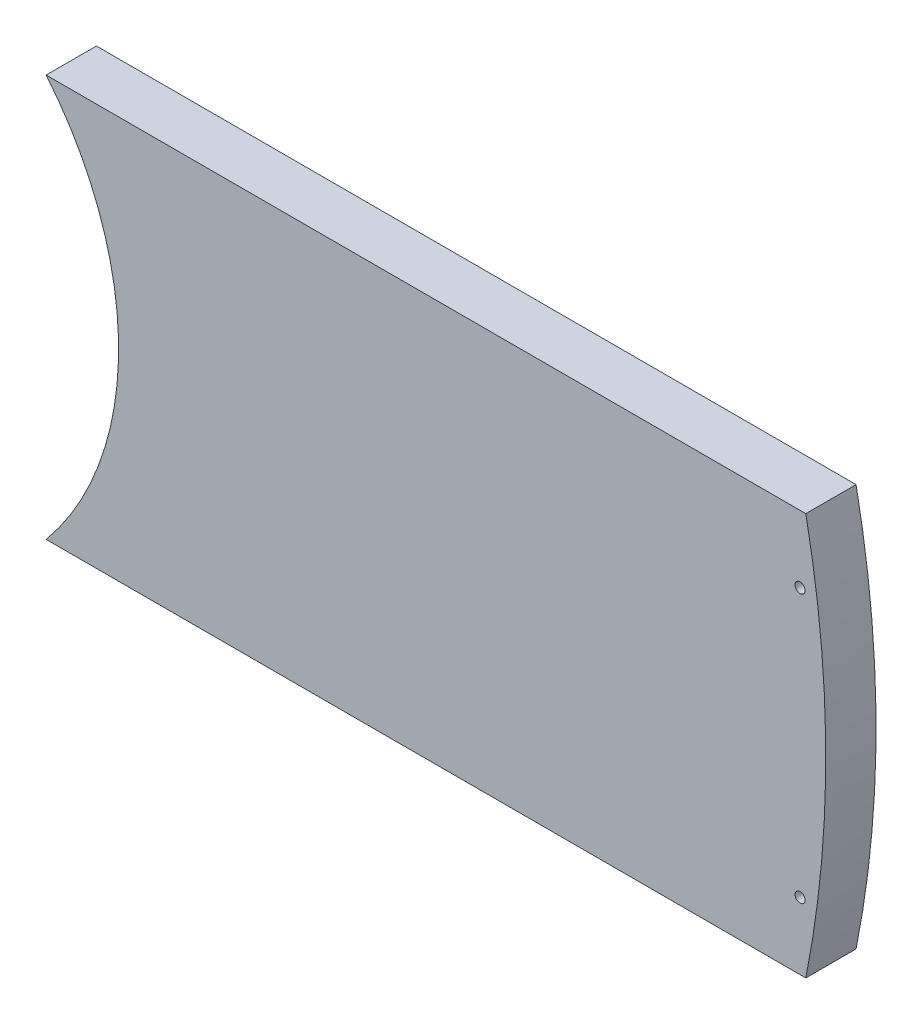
ISO-10303-21;
HEADER;
FILE_DESCRIPTION(('STEP AP214'),'2;1');
FILE_NAME('part.step','',(''),(''),'','','');
FILE_SCHEMA(('AUTOMOTIVE_DESIGN { 1 0 10303 214 1 1 1 1 }'));
ENDSEC;
DATA;
#1=APPLICATION_CONTEXT('core data for automotive mechanical design processes');
#2=APPLICATION_PROTOCOL_DEFINITION('international standard','automotive_design',2000,#1);
#3=PRODUCT_CONTEXT('',#1,'mechanical');
#4=PRODUCT('Part','Part','',(#3));
#5=PRODUCT_RELATED_PRODUCT_CATEGORY('part','',(#4));
#6=PRODUCT_DEFINITION_FORMATION('','',#4);
#7=PRODUCT_DEFINITION_CONTEXT('part definition',#1,'design');
#8=PRODUCT_DEFINITION('design','',#6,#7);
#9=PRODUCT_DEFINITION_SHAPE('','',#8);
#10=(LENGTH_UNIT() NAMED_UNIT(*) SI_UNIT(.MILLI.,.METRE.));
#11=(NAMED_UNIT(*) PLANE_ANGLE_UNIT() SI_UNIT($,.RADIAN.));
#12=(NAMED_UNIT(*) SI_UNIT($,.STERADIAN.) SOLID_ANGLE_UNIT());
#13=UNCERTAINTY_MEASURE_WITH_UNIT(LENGTH_MEASURE(1.E-05),#10,'distance_accuracy_value','');
#14=(GEOMETRIC_REPRESENTATION_CONTEXT(3) GLOBAL_UNCERTAINTY_ASSIGNED_CONTEXT((#13)) GLOBAL_UNIT_ASSIGNED_CONTEXT((#10,
#11,#12)) REPRESENTATION_CONTEXT('',''));
#15=CARTESIAN_POINT('',(0.,0.,0.));
#16=DIRECTION('',(0.,0.,1.));
#17=DIRECTION('',(1.,0.,0.));
#18=AXIS2_PLACEMENT_3D('',#15,#16,#17);
#19=CARTESIAN_POINT('',(0.,0.,15.));
#20=DIRECTION('',(0.,0.,1.));
#21=DIRECTION('',(1.,0.,0.));
#22=AXIS2_PLACEMENT_3D('',#19,#20,#21);
#23=PLANE('',#22);
#24=CARTESIAN_POINT('',(297.32137494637,40.,15.));
#25=DIRECTION('',(0.,0.,1.));
#26=DIRECTION('',(1.,0.,0.));
#27=AXIS2_PLACEMENT_3D('',#24,#25,#26);
#28=CIRCLE('',#27,1.50000000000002);
#29=CARTESIAN_POINT('',(298.82137494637,40.,15.));
#30=VERTEX_POINT('',#29);
#31=EDGE_CURVE('E290',#30,#30,#28,.T.);
#32=ORIENTED_EDGE('',*,*,#31,.F.);
#33=EDGE_LOOP('',(#32));
#34=FACE_BOUND('',#33,.T.);
#35=CARTESIAN_POINT('',(0.,0.,15.));
#36=DIRECTION('',(0.,0.,-1.));
#37=DIRECTION('',(1.,0.,0.));
#38=AXIS2_PLACEMENT_3D('',#35,#36,#37);
#39=CIRCLE('',#38,94.);
#40=CARTESIAN_POINT('',(72.3602100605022,60.,15.));
#41=VERTEX_POINT('',#40);
#42=CARTESIAN_POINT('',(72.3602100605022,-60.,15.));
#43=VERTEX_POINT('',#42);
#44=EDGE_CURVE('E296',#41,#43,#39,.T.);
#45=ORIENTED_EDGE('',*,*,#44,.T.);
#46=DIRECTION('',(1.,0.,0.));
#47=VECTOR('',#46,1.);
#48=CARTESIAN_POINT('',(72.3602100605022,-60.,15.));
#49=LINE('',#48,#47);
#50=CARTESIAN_POINT('',(299.040131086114,-60.0000000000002,15.));
#51=VERTEX_POINT('',#50);
#52=EDGE_CURVE('E299',#43,#51,#49,.T.);
#53=ORIENTED_EDGE('',*,*,#52,.T.);
#54=CARTESIAN_POINT('',(0.,0.,15.));
#55=DIRECTION('',(0.,0.,1.));
#56=DIRECTION('',(1.,0.,0.));
#57=AXIS2_PLACEMENT_3D('',#54,#55,#56);
#58=CIRCLE('',#57,305.);
#59=CARTESIAN_POINT('',(299.040131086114,60.,15.));
#60=VERTEX_POINT('',#59);
#61=EDGE_CURVE('E302',#51,#60,#58,.T.);
#62=ORIENTED_EDGE('',*,*,#61,.T.);
#63=DIRECTION('',(-1.,0.,0.));
#64=VECTOR('',#63,1.);
#65=CARTESIAN_POINT('',(72.3602100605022,60.,15.));
#66=LINE('',#65,#64);
#67=EDGE_CURVE('E304',#60,#41,#66,.T.);
#68=ORIENTED_EDGE('',*,*,#67,.T.);
#69=EDGE_LOOP('',(#45,#53,#62,#68));
#70=FACE_BOUND('',#69,.T.);
#71=CARTESIAN_POINT('',(297.32137494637,-40.,15.));
#72=DIRECTION('',(0.,0.,1.));
#73=DIRECTION('',(-1.,0.,0.));
#74=AXIS2_PLACEMENT_3D('',#71,#72,#73);
#75=CIRCLE('',#74,1.50000000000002);
#76=CARTESIAN_POINT('',(295.82137494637,-40.,15.));
#77=VERTEX_POINT('',#76);
#78=EDGE_CURVE('E284',#77,#77,#75,.T.);
#79=ORIENTED_EDGE('',*,*,#78,.F.);
#80=EDGE_LOOP('',(#79));
#81=FACE_BOUND('',#80,.T.);
#82=ADVANCED_FACE('F35',(#34,#70,#81),#23,.T.);
#83=CARTESIAN_POINT('',(0.,0.,0.));
#84=DIRECTION('',(0.,0.,1.));
#85=DIRECTION('',(1.,0.,0.));
#86=AXIS2_PLACEMENT_3D('',#83,#84,#85);
#87=PLANE('',#86);
#88=DIRECTION('',(1.,0.,0.));
#89=VECTOR('',#88,1.);
#90=CARTESIAN_POINT('',(118.,15.,0.));
#91=LINE('',#90,#89);
#92=CARTESIAN_POINT('',(95.8331884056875,15.,0.));
#93=VERTEX_POINT('',#92);
#94=CARTESIAN_POINT('',(121.,15.,0.));
#95=VERTEX_POINT('',#94);
#96=EDGE_CURVE('E248',#93,#95,#91,.T.);
#97=ORIENTED_EDGE('',*,*,#96,.T.);
#98=DIRECTION('',(0.,-1.,0.));
#99=VECTOR('',#98,1.);
#100=CARTESIAN_POINT('',(121.,12.,0.));
#101=LINE('',#100,#99);
#102=CARTESIAN_POINT('',(121.,-15.,0.));
#103=VERTEX_POINT('',#102);
#104=EDGE_CURVE('E534',#95,#103,#101,.T.);
#105=ORIENTED_EDGE('',*,*,#104,.T.);
#106=DIRECTION('',(-1.,0.,0.));
#107=VECTOR('',#106,1.);
#108=CARTESIAN_POINT('',(118.,-15.,0.));
#109=LINE('',#108,#107);
#110=CARTESIAN_POINT('',(95.8331884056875,-15.,0.));
#111=VERTEX_POINT('',#110);
#112=EDGE_CURVE('E539',#103,#111,#109,.T.);
#113=ORIENTED_EDGE('',*,*,#112,.T.);
#114=CARTESIAN_POINT('',(0.,0.,0.));
#115=DIRECTION('',(0.,0.,1.));
#116=DIRECTION('',(1.,0.,0.));
#117=AXIS2_PLACEMENT_3D('',#114,#115,#116);
#118=CIRCLE('',#117,97.);
#119=CARTESIAN_POINT('',(78.4856674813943,-57.,0.));
#120=VERTEX_POINT('',#119);
#121=EDGE_CURVE('E50',#111,#120,#118,.F.);
#122=ORIENTED_EDGE('',*,*,#121,.T.);
#123=DIRECTION('',(1.,0.,0.));
#124=VECTOR('',#123,1.);
#125=CARTESIAN_POINT('',(72.3602100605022,-57.,0.));
#126=LINE('',#125,#124);
#127=CARTESIAN_POINT('',(296.572082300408,-57.,0.));
#128=VERTEX_POINT('',#127);
#129=EDGE_CURVE('E546',#120,#128,#126,.T.);
#130=ORIENTED_EDGE('',*,*,#129,.T.);
#131=CARTESIAN_POINT('',(0.,0.,0.));
#132=DIRECTION('',(0.,0.,1.));
#133=DIRECTION('',(1.,0.,0.));
#134=AXIS2_PLACEMENT_3D('',#131,#132,#133);
#135=CIRCLE('',#134,302.);
#136=CARTESIAN_POINT('',(298.737415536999,-44.271396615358,0.));
#137=VERTEX_POINT('',#136);
#138=EDGE_CURVE('E193',#128,#137,#135,.T.);
#139=ORIENTED_EDGE('',*,*,#138,.T.);
#140=CARTESIAN_POINT('',(297.32137494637,-40.,0.));
#141=DIRECTION('',(0.,0.,1.));
#142=DIRECTION('',(1.,0.,0.));
#143=AXIS2_PLACEMENT_3D('',#140,#141,#142);
#144=CIRCLE('',#143,4.50000000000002);
#145=CARTESIAN_POINT('',(299.815936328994,-36.2547144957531,0.));
#146=VERTEX_POINT('',#145);
#147=EDGE_CURVE('E244',#146,#137,#144,.T.);
#148=ORIENTED_EDGE('',*,*,#147,.F.);
#149=CARTESIAN_POINT('',(299.815936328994,36.2547144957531,0.));
#150=VERTEX_POINT('',#149);
#151=EDGE_CURVE('E548',#146,#150,#135,.T.);
#152=ORIENTED_EDGE('',*,*,#151,.T.);
#153=CARTESIAN_POINT('',(297.32137494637,40.,0.));
#154=DIRECTION('',(0.,0.,1.));
#155=DIRECTION('',(1.,0.,0.));
#156=AXIS2_PLACEMENT_3D('',#153,#154,#155);
#157=CIRCLE('',#156,4.50000000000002);
#158=CARTESIAN_POINT('',(298.737415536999,44.271396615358,0.));
#159=VERTEX_POINT('',#158);
#160=EDGE_CURVE('E236',#159,#150,#157,.T.);
#161=ORIENTED_EDGE('',*,*,#160,.F.);
#162=CARTESIAN_POINT('',(296.572082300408,57.,0.));
#163=VERTEX_POINT('',#162);
#164=EDGE_CURVE('E232',#159,#163,#135,.T.);
#165=ORIENTED_EDGE('',*,*,#164,.T.);
#166=DIRECTION('',(-1.,0.,0.));
#167=VECTOR('',#166,1.);
#168=CARTESIAN_POINT('',(72.3602100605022,57.,0.));
#169=LINE('',#168,#167);
#170=CARTESIAN_POINT('',(78.4856674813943,57.,0.));
#171=VERTEX_POINT('',#170);
#172=EDGE_CURVE('E223',#163,#171,#169,.T.);
#173=ORIENTED_EDGE('',*,*,#172,.T.);
#174=CARTESIAN_POINT('',(0.,0.,0.));
#175=DIRECTION('',(0.,0.,1.));
#176=DIRECTION('',(1.,0.,0.));
#177=AXIS2_PLACEMENT_3D('',#174,#175,#176);
#178=CIRCLE('',#177,97.);
#179=EDGE_CURVE('E237',#171,#93,#178,.F.);
#180=ORIENTED_EDGE('',*,*,#179,.T.);
#181=EDGE_LOOP('',(#97,#105,#113,#122,#130,#139,#148,#152,#161,#165,#173,#180));
#182=FACE_BOUND('',#181,.T.);
#183=CARTESIAN_POINT('',(297.32137494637,40.,0.));
#184=DIRECTION('',(0.,0.,1.));
#185=DIRECTION('',(1.,0.,0.));
#186=AXIS2_PLACEMENT_3D('',#183,#184,#185);
#187=CIRCLE('',#186,1.50000000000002);
#188=CARTESIAN_POINT('',(298.82137494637,40.,0.));
#189=VERTEX_POINT('',#188);
#190=EDGE_CURVE('E287',#189,#189,#187,.T.);
#191=ORIENTED_EDGE('',*,*,#190,.T.);
#192=EDGE_LOOP('',(#191));
#193=FACE_BOUND('',#192,.T.);
#194=DIRECTION('',(0.,-1.,0.));
#195=VECTOR('',#194,1.);
#196=CARTESIAN_POINT('',(118.,12.,0.));
#197=LINE('',#196,#195);
#198=CARTESIAN_POINT('',(118.,12.,0.));
#199=VERTEX_POINT('',#198);
#200=CARTESIAN_POINT('',(118.,-12.,0.));
#201=VERTEX_POINT('',#200);
#202=EDGE_CURVE('E266',#199,#201,#197,.T.);
#203=ORIENTED_EDGE('',*,*,#202,.F.);
#204=DIRECTION('',(1.,0.,0.));
#205=VECTOR('',#204,1.);
#206=CARTESIAN_POINT('',(118.,12.,0.));
#207=LINE('',#206,#205);
#208=CARTESIAN_POINT('',(93.2308961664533,12.,0.));
#209=VERTEX_POINT('',#208);
#210=EDGE_CURVE('E269',#209,#199,#207,.T.);
#211=ORIENTED_EDGE('',*,*,#210,.F.);
#212=CARTESIAN_POINT('',(0.,0.,0.));
#213=DIRECTION('',(0.,0.,-1.));
#214=DIRECTION('',(1.,0.,0.));
#215=AXIS2_PLACEMENT_3D('',#212,#213,#214);
#216=CIRCLE('',#215,94.);
#217=CARTESIAN_POINT('',(72.3602100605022,60.,0.));
#218=VERTEX_POINT('',#217);
#219=EDGE_CURVE('E307',#218,#209,#216,.T.);
#220=ORIENTED_EDGE('',*,*,#219,.F.);
#221=DIRECTION('',(-1.,0.,0.));
#222=VECTOR('',#221,1.);
#223=CARTESIAN_POINT('',(72.3602100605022,60.,0.));
#224=LINE('',#223,#222);
#225=CARTESIAN_POINT('',(299.040131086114,60.,0.));
#226=VERTEX_POINT('',#225);
#227=EDGE_CURVE('E300',#226,#218,#224,.T.);
#228=ORIENTED_EDGE('',*,*,#227,.F.);
#229=CARTESIAN_POINT('',(0.,0.,0.));
#230=DIRECTION('',(0.,0.,1.));
#231=DIRECTION('',(1.,0.,0.));
#232=AXIS2_PLACEMENT_3D('',#229,#230,#231);
#233=CIRCLE('',#232,305.);
#234=CARTESIAN_POINT('',(299.040131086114,-60.0000000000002,0.));
#235=VERTEX_POINT('',#234);
#236=EDGE_CURVE('E312',#235,#226,#233,.T.);
#237=ORIENTED_EDGE('',*,*,#236,.F.);
#238=DIRECTION('',(1.,0.,0.));
#239=VECTOR('',#238,1.);
#240=CARTESIAN_POINT('',(72.3602100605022,-60.,0.));
#241=LINE('',#240,#239);
#242=CARTESIAN_POINT('',(72.3602100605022,-60.,0.));
#243=VERTEX_POINT('',#242);
#244=EDGE_CURVE('E310',#243,#235,#241,.T.);
#245=ORIENTED_EDGE('',*,*,#244,.F.);
#246=CARTESIAN_POINT('',(93.2308961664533,-12.,0.));
#247=VERTEX_POINT('',#246);
#248=EDGE_CURVE('E293',#247,#243,#216,.T.);
#249=ORIENTED_EDGE('',*,*,#248,.F.);
#250=DIRECTION('',(-1.,0.,0.));
#251=VECTOR('',#250,1.);
#252=CARTESIAN_POINT('',(118.,-12.,0.));
#253=LINE('',#252,#251);
#254=EDGE_CURVE('E276',#201,#247,#253,.T.);
#255=ORIENTED_EDGE('',*,*,#254,.F.);
#256=EDGE_LOOP('',(#203,#211,#220,#228,#237,#245,#249,#255));
#257=FACE_BOUND('',#256,.T.);
#258=CARTESIAN_POINT('',(297.32137494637,-40.,0.));
#259=DIRECTION('',(0.,0.,1.));
#260=DIRECTION('',(-1.,0.,0.));
#261=AXIS2_PLACEMENT_3D('',#258,#259,#260);
#262=CIRCLE('',#261,1.50000000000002);
#263=CARTESIAN_POINT('',(295.82137494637,-40.,0.));
#264=VERTEX_POINT('',#263);
#265=EDGE_CURVE('E282',#264,#264,#262,.T.);
#266=ORIENTED_EDGE('',*,*,#265,.T.);
#267=EDGE_LOOP('',(#266));
#268=FACE_BOUND('',#267,.T.);
#269=ADVANCED_FACE('F337',(#182,#193,#257,#268),#87,.F.);
#270=CARTESIAN_POINT('',(0.,0.,15.));
#271=DIRECTION('',(0.,0.,-1.));
#272=DIRECTION('',(-1.,0.,0.));
#273=AXIS2_PLACEMENT_3D('',#270,#271,#272);
#274=CYLINDRICAL_SURFACE('',#273,94.);
#275=ORIENTED_EDGE('',*,*,#219,.T.);
#276=DIRECTION('',(0.,0.,-1.));
#277=VECTOR('',#276,1.);
#278=CARTESIAN_POINT('',(93.2308961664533,12.,15.));
#279=LINE('',#278,#277);
#280=CARTESIAN_POINT('',(93.2308961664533,12.,12.));
#281=VERTEX_POINT('',#280);
#282=EDGE_CURVE('E11',#209,#281,#279,.F.);
#283=ORIENTED_EDGE('',*,*,#282,.T.);
#284=CARTESIAN_POINT('',(0.,0.,12.));
#285=DIRECTION('',(0.,0.,-1.));
#286=DIRECTION('',(-1.,0.,0.));
#287=AXIS2_PLACEMENT_3D('',#284,#285,#286);
#288=CIRCLE('',#287,94.);
#289=CARTESIAN_POINT('',(93.2308961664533,-12.,12.));
#290=VERTEX_POINT('',#289);
#291=EDGE_CURVE('E326',#290,#281,#288,.F.);
#292=ORIENTED_EDGE('',*,*,#291,.F.);
#293=DIRECTION('',(0.,0.,-1.));
#294=VECTOR('',#293,1.);
#295=CARTESIAN_POINT('',(93.2308961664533,-12.,15.));
#296=LINE('',#295,#294);
#297=EDGE_CURVE('E43',#290,#247,#296,.T.);
#298=ORIENTED_EDGE('',*,*,#297,.T.);
#299=ORIENTED_EDGE('',*,*,#248,.T.);
#300=DIRECTION('',(0.,0.,-1.));
#301=VECTOR('',#300,1.);
#302=CARTESIAN_POINT('',(72.3602100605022,-60.,15.));
#303=LINE('',#302,#301);
#304=EDGE_CURVE('E323',#43,#243,#303,.T.);
#305=ORIENTED_EDGE('',*,*,#304,.F.);
#306=ORIENTED_EDGE('',*,*,#44,.F.);
#307=DIRECTION('',(0.,0.,-1.));
#308=VECTOR('',#307,1.);
#309=CARTESIAN_POINT('',(72.3602100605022,60.,15.));
#310=LINE('',#309,#308);
#311=EDGE_CURVE('E306',#41,#218,#310,.T.);
#312=ORIENTED_EDGE('',*,*,#311,.T.);
#313=EDGE_LOOP('',(#275,#283,#292,#298,#299,#305,#306,#312));
#314=FACE_BOUND('',#313,.T.);
#315=ADVANCED_FACE('F37',(#314),#274,.F.);
#316=CARTESIAN_POINT('',(72.3602100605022,-60.,15.));
#317=DIRECTION('',(0.,1.,0.));
#318=DIRECTION('',(0.,0.,1.));
#319=AXIS2_PLACEMENT_3D('',#316,#317,#318);
#320=PLANE('',#319);
#321=ORIENTED_EDGE('',*,*,#244,.T.);
#322=DIRECTION('',(0.,0.,-1.));
#323=VECTOR('',#322,1.);
#324=CARTESIAN_POINT('',(299.040131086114,-60.0000000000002,15.));
#325=LINE('',#324,#323);
#326=EDGE_CURVE('E320',#51,#235,#325,.T.);
#327=ORIENTED_EDGE('',*,*,#326,.F.);
#328=ORIENTED_EDGE('',*,*,#52,.F.);
#329=ORIENTED_EDGE('',*,*,#304,.T.);
#330=EDGE_LOOP('',(#321,#327,#328,#329));
#331=FACE_BOUND('',#330,.T.);
#332=ADVANCED_FACE('F343',(#331),#320,.F.);
#333=CARTESIAN_POINT('',(0.,0.,15.));
#334=DIRECTION('',(0.,0.,-1.));
#335=DIRECTION('',(-1.,0.,0.));
#336=AXIS2_PLACEMENT_3D('',#333,#334,#335);
#337=CYLINDRICAL_SURFACE('',#336,305.);
#338=ORIENTED_EDGE('',*,*,#236,.T.);
#339=DIRECTION('',(0.,0.,-1.));
#340=VECTOR('',#339,1.);
#341=CARTESIAN_POINT('',(299.040131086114,60.,15.));
#342=LINE('',#341,#340);
#343=EDGE_CURVE('E317',#60,#226,#342,.T.);
#344=ORIENTED_EDGE('',*,*,#343,.F.);
#345=ORIENTED_EDGE('',*,*,#61,.F.);
#346=ORIENTED_EDGE('',*,*,#326,.T.);
#347=EDGE_LOOP('',(#338,#344,#345,#346));
#348=FACE_BOUND('',#347,.T.);
#349=ADVANCED_FACE('F389',(#348),#337,.T.);
#350=CARTESIAN_POINT('',(72.3602100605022,60.,15.));
#351=DIRECTION('',(0.,-1.,0.));
#352=DIRECTION('',(0.,0.,-1.));
#353=AXIS2_PLACEMENT_3D('',#350,#351,#352);
#354=PLANE('',#353);
#355=ORIENTED_EDGE('',*,*,#227,.T.);
#356=ORIENTED_EDGE('',*,*,#311,.F.);
#357=ORIENTED_EDGE('',*,*,#67,.F.);
#358=ORIENTED_EDGE('',*,*,#343,.T.);
#359=EDGE_LOOP('',(#355,#356,#357,#358));
#360=FACE_BOUND('',#359,.T.);
#361=ADVANCED_FACE('F353',(#360),#354,.F.);
#362=CARTESIAN_POINT('',(297.32137494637,40.,15.));
#363=DIRECTION('',(0.,0.,-1.));
#364=DIRECTION('',(-1.,0.,0.));
#365=AXIS2_PLACEMENT_3D('',#362,#363,#364);
#366=CYLINDRICAL_SURFACE('',#365,1.50000000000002);
#367=ORIENTED_EDGE('',*,*,#31,.T.);
#368=EDGE_LOOP('',(#367));
#369=FACE_BOUND('',#368,.T.);
#370=ORIENTED_EDGE('',*,*,#190,.F.);
#371=EDGE_LOOP('',(#370));
#372=FACE_BOUND('',#371,.T.);
#373=ADVANCED_FACE('F384',(#369,#372),#366,.F.);
#374=CARTESIAN_POINT('',(297.32137494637,-40.,15.));
#375=DIRECTION('',(0.,0.,-1.));
#376=DIRECTION('',(-1.,0.,0.));
#377=AXIS2_PLACEMENT_3D('',#374,#375,#376);
#378=CYLINDRICAL_SURFACE('',#377,1.50000000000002);
#379=ORIENTED_EDGE('',*,*,#78,.T.);
#380=EDGE_LOOP('',(#379));
#381=FACE_BOUND('',#380,.T.);
#382=ORIENTED_EDGE('',*,*,#265,.F.);
#383=EDGE_LOOP('',(#382));
#384=FACE_BOUND('',#383,.T.);
#385=ADVANCED_FACE('F371',(#381,#384),#378,.F.);
#386=CARTESIAN_POINT('',(118.,12.,12.));
#387=DIRECTION('',(0.,1.,0.));
#388=DIRECTION('',(-1.,0.,0.));
#389=AXIS2_PLACEMENT_3D('',#386,#387,#388);
#390=PLANE('',#389);
#391=ORIENTED_EDGE('',*,*,#210,.T.);
#392=DIRECTION('',(0.,0.,-1.));
#393=VECTOR('',#392,1.);
#394=CARTESIAN_POINT('',(118.,12.,12.));
#395=LINE('',#394,#393);
#396=CARTESIAN_POINT('',(118.,12.,12.));
#397=VERTEX_POINT('',#396);
#398=EDGE_CURVE('E279',#397,#199,#395,.T.);
#399=ORIENTED_EDGE('',*,*,#398,.F.);
#400=DIRECTION('',(1.,0.,0.));
#401=VECTOR('',#400,1.);
#402=CARTESIAN_POINT('',(118.,12.,12.));
#403=LINE('',#402,#401);
#404=EDGE_CURVE('E271',#281,#397,#403,.T.);
#405=ORIENTED_EDGE('',*,*,#404,.F.);
#406=ORIENTED_EDGE('',*,*,#282,.F.);
#407=EDGE_LOOP('',(#391,#399,#405,#406));
#408=FACE_BOUND('',#407,.T.);
#409=ADVANCED_FACE('F357',(#408),#390,.F.);
#410=CARTESIAN_POINT('',(118.,-12.,12.));
#411=DIRECTION('',(0.,-1.,0.));
#412=DIRECTION('',(1.,0.,0.));
#413=AXIS2_PLACEMENT_3D('',#410,#411,#412);
#414=PLANE('',#413);
#415=DIRECTION('',(-1.,0.,0.));
#416=VECTOR('',#415,1.);
#417=CARTESIAN_POINT('',(118.,-12.,12.));
#418=LINE('',#417,#416);
#419=CARTESIAN_POINT('',(118.,-12.,12.));
#420=VERTEX_POINT('',#419);
#421=EDGE_CURVE('E58',#420,#290,#418,.T.);
#422=ORIENTED_EDGE('',*,*,#421,.F.);
#423=DIRECTION('',(0.,0.,-1.));
#424=VECTOR('',#423,1.);
#425=CARTESIAN_POINT('',(118.,-12.,12.));
#426=LINE('',#425,#424);
#427=EDGE_CURVE('E273',#420,#201,#426,.T.);
#428=ORIENTED_EDGE('',*,*,#427,.T.);
#429=ORIENTED_EDGE('',*,*,#254,.T.);
#430=ORIENTED_EDGE('',*,*,#297,.F.);
#431=EDGE_LOOP('',(#422,#428,#429,#430));
#432=FACE_BOUND('',#431,.T.);
#433=ADVANCED_FACE('F363',(#432),#414,.F.);
#434=CARTESIAN_POINT('',(0.,0.,12.));
#435=DIRECTION('',(0.,0.,-1.));
#436=DIRECTION('',(-1.,0.,0.));
#437=AXIS2_PLACEMENT_3D('',#434,#435,#436);
#438=PLANE('',#437);
#439=ORIENTED_EDGE('',*,*,#291,.T.);
#440=ORIENTED_EDGE('',*,*,#404,.T.);
#441=DIRECTION('',(0.,-1.,0.));
#442=VECTOR('',#441,1.);
#443=CARTESIAN_POINT('',(118.,12.,12.));
#444=LINE('',#443,#442);
#445=EDGE_CURVE('E267',#397,#420,#444,.T.);
#446=ORIENTED_EDGE('',*,*,#445,.T.);
#447=ORIENTED_EDGE('',*,*,#421,.T.);
#448=EDGE_LOOP('',(#439,#440,#446,#447));
#449=FACE_BOUND('',#448,.T.);
#450=ADVANCED_FACE('F360',(#449),#438,.T.);
#451=CARTESIAN_POINT('',(118.,12.,12.));
#452=DIRECTION('',(1.,0.,0.));
#453=DIRECTION('',(0.,0.,-1.));
#454=AXIS2_PLACEMENT_3D('',#451,#452,#453);
#455=PLANE('',#454);
#456=ORIENTED_EDGE('',*,*,#202,.T.);
#457=ORIENTED_EDGE('',*,*,#427,.F.);
#458=ORIENTED_EDGE('',*,*,#445,.F.);
#459=ORIENTED_EDGE('',*,*,#398,.T.);
#460=EDGE_LOOP('',(#456,#457,#458,#459));
#461=FACE_BOUND('',#460,.T.);
#462=ADVANCED_FACE('F362',(#461),#455,.F.);
#463=CARTESIAN_POINT('',(0.,0.,12.));
#464=DIRECTION('',(0.,0.,1.));
#465=DIRECTION('',(1.,0.,0.));
#466=AXIS2_PLACEMENT_3D('',#463,#464,#465);
#467=PLANE('',#466);
#468=DIRECTION('',(0.,1.,0.));
#469=VECTOR('',#468,1.);
#470=CARTESIAN_POINT('',(121.,0.,12.));
#471=LINE('',#470,#469);
#472=CARTESIAN_POINT('',(121.,-15.,12.));
#473=VERTEX_POINT('',#472);
#474=CARTESIAN_POINT('',(121.,15.,12.));
#475=VERTEX_POINT('',#474);
#476=EDGE_CURVE('E264',#473,#475,#471,.T.);
#477=ORIENTED_EDGE('',*,*,#476,.T.);
#478=DIRECTION('',(1.,0.,0.));
#479=VECTOR('',#478,1.);
#480=CARTESIAN_POINT('',(118.,15.,12.));
#481=LINE('',#480,#479);
#482=CARTESIAN_POINT('',(95.8331884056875,15.,12.));
#483=VERTEX_POINT('',#482);
#484=EDGE_CURVE('E228',#483,#475,#481,.T.);
#485=ORIENTED_EDGE('',*,*,#484,.F.);
#486=CARTESIAN_POINT('',(0.,0.,12.));
#487=DIRECTION('',(0.,0.,1.));
#488=DIRECTION('',(1.,0.,0.));
#489=AXIS2_PLACEMENT_3D('',#486,#487,#488);
#490=CIRCLE('',#489,97.);
#491=CARTESIAN_POINT('',(78.4856674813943,57.,12.));
#492=VERTEX_POINT('',#491);
#493=EDGE_CURVE('E227',#492,#483,#490,.F.);
#494=ORIENTED_EDGE('',*,*,#493,.F.);
#495=DIRECTION('',(-1.,0.,0.));
#496=VECTOR('',#495,1.);
#497=CARTESIAN_POINT('',(72.3602100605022,57.,12.));
#498=LINE('',#497,#496);
#499=CARTESIAN_POINT('',(296.572082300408,57.,12.));
#500=VERTEX_POINT('',#499);
#501=EDGE_CURVE('E202',#500,#492,#498,.T.);
#502=ORIENTED_EDGE('',*,*,#501,.F.);
#503=CARTESIAN_POINT('',(0.,0.,12.));
#504=DIRECTION('',(0.,0.,1.));
#505=DIRECTION('',(1.,0.,0.));
#506=AXIS2_PLACEMENT_3D('',#503,#504,#505);
#507=CIRCLE('',#506,302.);
#508=CARTESIAN_POINT('',(298.737415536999,44.271396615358,12.));
#509=VERTEX_POINT('',#508);
#510=EDGE_CURVE('E185',#509,#500,#507,.T.);
#511=ORIENTED_EDGE('',*,*,#510,.F.);
#512=CARTESIAN_POINT('',(297.32137494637,40.,12.));
#513=DIRECTION('',(0.,0.,1.));
#514=DIRECTION('',(1.,0.,0.));
#515=AXIS2_PLACEMENT_3D('',#512,#513,#514);
#516=CIRCLE('',#515,4.50000000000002);
#517=CARTESIAN_POINT('',(299.815936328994,36.2547144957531,12.));
#518=VERTEX_POINT('',#517);
#519=EDGE_CURVE('E235',#509,#518,#516,.T.);
#520=ORIENTED_EDGE('',*,*,#519,.T.);
#521=CARTESIAN_POINT('',(299.815936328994,-36.2547144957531,12.));
#522=VERTEX_POINT('',#521);
#523=EDGE_CURVE('E203',#522,#518,#507,.T.);
#524=ORIENTED_EDGE('',*,*,#523,.F.);
#525=CARTESIAN_POINT('',(297.32137494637,-40.,12.));
#526=DIRECTION('',(0.,0.,1.));
#527=DIRECTION('',(1.,0.,0.));
#528=AXIS2_PLACEMENT_3D('',#525,#526,#527);
#529=CIRCLE('',#528,4.50000000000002);
#530=CARTESIAN_POINT('',(298.737415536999,-44.271396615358,12.));
#531=VERTEX_POINT('',#530);
#532=EDGE_CURVE('E201',#522,#531,#529,.T.);
#533=ORIENTED_EDGE('',*,*,#532,.T.);
#534=CARTESIAN_POINT('',(296.572082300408,-57.,12.));
#535=VERTEX_POINT('',#534);
#536=EDGE_CURVE('E191',#535,#531,#507,.T.);
#537=ORIENTED_EDGE('',*,*,#536,.F.);
#538=DIRECTION('',(1.,0.,0.));
#539=VECTOR('',#538,1.);
#540=CARTESIAN_POINT('',(72.3602100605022,-57.,12.));
#541=LINE('',#540,#539);
#542=CARTESIAN_POINT('',(78.4856674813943,-57.,12.));
#543=VERTEX_POINT('',#542);
#544=EDGE_CURVE('E175',#543,#535,#541,.T.);
#545=ORIENTED_EDGE('',*,*,#544,.F.);
#546=CARTESIAN_POINT('',(95.8331884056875,-15.,12.));
#547=VERTEX_POINT('',#546);
#548=EDGE_CURVE('E186',#547,#543,#490,.F.);
#549=ORIENTED_EDGE('',*,*,#548,.F.);
#550=DIRECTION('',(-1.,0.,0.));
#551=VECTOR('',#550,1.);
#552=CARTESIAN_POINT('',(118.,-15.,12.));
#553=LINE('',#552,#551);
#554=EDGE_CURVE('E262',#473,#547,#553,.T.);
#555=ORIENTED_EDGE('',*,*,#554,.F.);
#556=EDGE_LOOP('',(#477,#485,#494,#502,#511,#520,#524,#533,#537,#545,#549,#555));
#557=FACE_BOUND('',#556,.T.);
#558=ADVANCED_FACE('F198',(#557),#467,.F.);
#559=CARTESIAN_POINT('',(118.,15.,12.));
#560=DIRECTION('',(0.,1.,0.));
#561=DIRECTION('',(-1.,0.,0.));
#562=AXIS2_PLACEMENT_3D('',#559,#560,#561);
#563=PLANE('',#562);
#564=ORIENTED_EDGE('',*,*,#484,.T.);
#565=DIRECTION('',(0.,0.,-1.));
#566=VECTOR('',#565,1.);
#567=CARTESIAN_POINT('',(121.,15.,12.));
#568=LINE('',#567,#566);
#569=EDGE_CURVE('E252',#475,#95,#568,.T.);
#570=ORIENTED_EDGE('',*,*,#569,.T.);
#571=ORIENTED_EDGE('',*,*,#96,.F.);
#572=DIRECTION('',(0.,0.,-1.));
#573=VECTOR('',#572,1.);
#574=CARTESIAN_POINT('',(95.8331884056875,15.,0.));
#575=LINE('',#574,#573);
#576=EDGE_CURVE('E256',#93,#483,#575,.F.);
#577=ORIENTED_EDGE('',*,*,#576,.T.);
#578=EDGE_LOOP('',(#564,#570,#571,#577));
#579=FACE_BOUND('',#578,.T.);
#580=ADVANCED_FACE('F419',(#579),#563,.T.);
#581=CARTESIAN_POINT('',(0.,0.,15.));
#582=DIRECTION('',(0.,0.,-1.));
#583=DIRECTION('',(-1.,0.,0.));
#584=AXIS2_PLACEMENT_3D('',#581,#582,#583);
#585=CYLINDRICAL_SURFACE('',#584,302.);
#586=ORIENTED_EDGE('',*,*,#510,.T.);
#587=DIRECTION('',(0.,0.,-1.));
#588=VECTOR('',#587,1.);
#589=CARTESIAN_POINT('',(296.572082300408,57.,12.));
#590=LINE('',#589,#588);
#591=EDGE_CURVE('E194',#500,#163,#590,.T.);
#592=ORIENTED_EDGE('',*,*,#591,.T.);
#593=ORIENTED_EDGE('',*,*,#164,.F.);
#594=DIRECTION('',(0.,0.,-1.));
#595=VECTOR('',#594,1.);
#596=CARTESIAN_POINT('',(298.737415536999,44.271396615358,15.));
#597=LINE('',#596,#595);
#598=EDGE_CURVE('E215',#509,#159,#597,.T.);
#599=ORIENTED_EDGE('',*,*,#598,.F.);
#600=EDGE_LOOP('',(#586,#592,#593,#599));
#601=FACE_BOUND('',#600,.T.);
#602=ADVANCED_FACE('F212',(#601),#585,.F.);
#603=DIRECTION('',(0.,0.,-1.));
#604=VECTOR('',#603,1.);
#605=CARTESIAN_POINT('',(299.815936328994,36.2547144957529,15.));
#606=LINE('',#605,#604);
#607=EDGE_CURVE('E258',#518,#150,#606,.T.);
#608=ORIENTED_EDGE('',*,*,#607,.T.);
#609=ORIENTED_EDGE('',*,*,#151,.F.);
#610=DIRECTION('',(0.,0.,-1.));
#611=VECTOR('',#610,1.);
#612=CARTESIAN_POINT('',(299.815936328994,-36.2547144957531,15.));
#613=LINE('',#612,#611);
#614=EDGE_CURVE('E255',#522,#146,#613,.T.);
#615=ORIENTED_EDGE('',*,*,#614,.F.);
#616=ORIENTED_EDGE('',*,*,#523,.T.);
#617=EDGE_LOOP('',(#608,#609,#615,#616));
#618=FACE_BOUND('',#617,.T.);
#619=ADVANCED_FACE('F440',(#618),#585,.F.);
#620=CARTESIAN_POINT('',(0.,0.,15.));
#621=DIRECTION('',(0.,0.,-1.));
#622=DIRECTION('',(-1.,0.,0.));
#623=AXIS2_PLACEMENT_3D('',#620,#621,#622);
#624=CYLINDRICAL_SURFACE('',#623,97.);
#625=ORIENTED_EDGE('',*,*,#576,.F.);
#626=ORIENTED_EDGE('',*,*,#179,.F.);
#627=DIRECTION('',(0.,0.,-1.));
#628=VECTOR('',#627,1.);
#629=CARTESIAN_POINT('',(78.4856674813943,57.,12.));
#630=LINE('',#629,#628);
#631=EDGE_CURVE('E206',#492,#171,#630,.T.);
#632=ORIENTED_EDGE('',*,*,#631,.F.);
#633=ORIENTED_EDGE('',*,*,#493,.T.);
#634=EDGE_LOOP('',(#625,#626,#632,#633));
#635=FACE_BOUND('',#634,.T.);
#636=ADVANCED_FACE('F450',(#635),#624,.T.);
#637=ORIENTED_EDGE('',*,*,#548,.T.);
#638=DIRECTION('',(0.,0.,-1.));
#639=VECTOR('',#638,1.);
#640=CARTESIAN_POINT('',(78.4856674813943,-57.,12.));
#641=LINE('',#640,#639);
#642=EDGE_CURVE('E180',#543,#120,#641,.T.);
#643=ORIENTED_EDGE('',*,*,#642,.T.);
#644=ORIENTED_EDGE('',*,*,#121,.F.);
#645=DIRECTION('',(0.,0.,-1.));
#646=VECTOR('',#645,1.);
#647=CARTESIAN_POINT('',(95.8331884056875,-15.,15.));
#648=LINE('',#647,#646);
#649=EDGE_CURVE('E540',#547,#111,#648,.T.);
#650=ORIENTED_EDGE('',*,*,#649,.F.);
#651=EDGE_LOOP('',(#637,#643,#644,#650));
#652=FACE_BOUND('',#651,.T.);
#653=ADVANCED_FACE('F460',(#652),#624,.T.);
#654=CARTESIAN_POINT('',(72.3602100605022,-57.,15.));
#655=DIRECTION('',(0.,1.,0.));
#656=DIRECTION('',(0.,0.,1.));
#657=AXIS2_PLACEMENT_3D('',#654,#655,#656);
#658=PLANE('',#657);
#659=ORIENTED_EDGE('',*,*,#129,.F.);
#660=ORIENTED_EDGE('',*,*,#642,.F.);
#661=ORIENTED_EDGE('',*,*,#544,.T.);
#662=DIRECTION('',(0.,0.,-1.));
#663=VECTOR('',#662,1.);
#664=CARTESIAN_POINT('',(296.572082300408,-57.,12.));
#665=LINE('',#664,#663);
#666=EDGE_CURVE('E178',#535,#128,#665,.T.);
#667=ORIENTED_EDGE('',*,*,#666,.T.);
#668=EDGE_LOOP('',(#659,#660,#661,#667));
#669=FACE_BOUND('',#668,.T.);
#670=ADVANCED_FACE('F177',(#669),#658,.T.);
#671=DIRECTION('',(0.,0.,-1.));
#672=VECTOR('',#671,1.);
#673=CARTESIAN_POINT('',(298.737415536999,-44.2713966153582,15.));
#674=LINE('',#673,#672);
#675=EDGE_CURVE('E253',#531,#137,#674,.T.);
#676=ORIENTED_EDGE('',*,*,#675,.T.);
#677=ORIENTED_EDGE('',*,*,#138,.F.);
#678=ORIENTED_EDGE('',*,*,#666,.F.);
#679=ORIENTED_EDGE('',*,*,#536,.T.);
#680=EDGE_LOOP('',(#676,#677,#678,#679));
#681=FACE_BOUND('',#680,.T.);
#682=ADVANCED_FACE('F190',(#681),#585,.F.);
#683=CARTESIAN_POINT('',(72.3602100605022,57.,15.));
#684=DIRECTION('',(0.,-1.,0.));
#685=DIRECTION('',(0.,0.,-1.));
#686=AXIS2_PLACEMENT_3D('',#683,#684,#685);
#687=PLANE('',#686);
#688=ORIENTED_EDGE('',*,*,#172,.F.);
#689=ORIENTED_EDGE('',*,*,#591,.F.);
#690=ORIENTED_EDGE('',*,*,#501,.T.);
#691=ORIENTED_EDGE('',*,*,#631,.T.);
#692=EDGE_LOOP('',(#688,#689,#690,#691));
#693=FACE_BOUND('',#692,.T.);
#694=ADVANCED_FACE('F220',(#693),#687,.T.);
#695=CARTESIAN_POINT('',(297.32137494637,40.,15.));
#696=DIRECTION('',(0.,0.,-1.));
#697=DIRECTION('',(-1.,0.,0.));
#698=AXIS2_PLACEMENT_3D('',#695,#696,#697);
#699=CYLINDRICAL_SURFACE('',#698,4.50000000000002);
#700=ORIENTED_EDGE('',*,*,#598,.T.);
#701=ORIENTED_EDGE('',*,*,#160,.T.);
#702=ORIENTED_EDGE('',*,*,#607,.F.);
#703=ORIENTED_EDGE('',*,*,#519,.F.);
#704=EDGE_LOOP('',(#700,#701,#702,#703));
#705=FACE_BOUND('',#704,.T.);
#706=ADVANCED_FACE('F488',(#705),#699,.T.);
#707=CARTESIAN_POINT('',(297.32137494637,-40.,15.));
#708=DIRECTION('',(0.,0.,-1.));
#709=DIRECTION('',(-1.,0.,0.));
#710=AXIS2_PLACEMENT_3D('',#707,#708,#709);
#711=CYLINDRICAL_SURFACE('',#710,4.50000000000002);
#712=ORIENTED_EDGE('',*,*,#614,.T.);
#713=ORIENTED_EDGE('',*,*,#147,.T.);
#714=ORIENTED_EDGE('',*,*,#675,.F.);
#715=ORIENTED_EDGE('',*,*,#532,.F.);
#716=EDGE_LOOP('',(#712,#713,#714,#715));
#717=FACE_BOUND('',#716,.T.);
#718=ADVANCED_FACE('F497',(#717),#711,.T.);
#719=CARTESIAN_POINT('',(118.,-15.,12.));
#720=DIRECTION('',(0.,-1.,0.));
#721=DIRECTION('',(1.,0.,0.));
#722=AXIS2_PLACEMENT_3D('',#719,#720,#721);
#723=PLANE('',#722);
#724=ORIENTED_EDGE('',*,*,#554,.T.);
#725=ORIENTED_EDGE('',*,*,#649,.T.);
#726=ORIENTED_EDGE('',*,*,#112,.F.);
#727=DIRECTION('',(0.,0.,-1.));
#728=VECTOR('',#727,1.);
#729=CARTESIAN_POINT('',(121.,-15.,12.));
#730=LINE('',#729,#728);
#731=EDGE_CURVE('E530',#473,#103,#730,.T.);
#732=ORIENTED_EDGE('',*,*,#731,.F.);
#733=EDGE_LOOP('',(#724,#725,#726,#732));
#734=FACE_BOUND('',#733,.T.);
#735=ADVANCED_FACE('F505',(#734),#723,.T.);
#736=CARTESIAN_POINT('',(121.,12.,12.));
#737=DIRECTION('',(1.,0.,0.));
#738=DIRECTION('',(0.,0.,-1.));
#739=AXIS2_PLACEMENT_3D('',#736,#737,#738);
#740=PLANE('',#739);
#741=ORIENTED_EDGE('',*,*,#731,.T.);
#742=ORIENTED_EDGE('',*,*,#104,.F.);
#743=ORIENTED_EDGE('',*,*,#569,.F.);
#744=ORIENTED_EDGE('',*,*,#476,.F.);
#745=EDGE_LOOP('',(#741,#742,#743,#744));
#746=FACE_BOUND('',#745,.T.);
#747=ADVANCED_FACE('F514',(#746),#740,.T.);
#748=CLOSED_SHELL('',(#82,#269,#315,#332,#349,#361,#373,#385,#409,#433,#450,#462,#558,#580,#602,
#619,#636,#653,#670,#682,#694,#706,#718,#735,#747));
#749=MANIFOLD_SOLID_BREP('B2',#748);
#750=ADVANCED_BREP_SHAPE_REPRESENTATION('',(#18,#749),#14);
#751=SHAPE_DEFINITION_REPRESENTATION(#9,#750);
ENDSEC;
END-ISO-10303-21;
